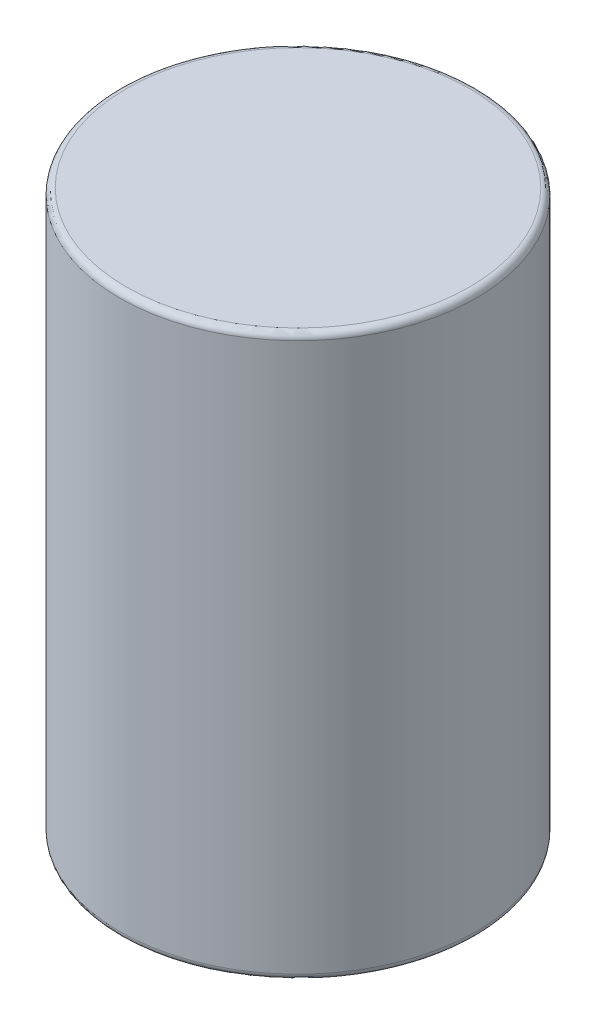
from build123d import *

# Parameters (mm, degrees)
SKETCH1_R           = 8.25
BOSS_EXTRUDE1_DEPTH = 26
FILLET1_R           = 0.3
SKETCH2_R           = 0.375
BOSS_EXTRUDE2_DEPTH = 3


with BuildPart() as part:
    # Sketch1 → Boss-Extrude1 (new body)
    with BuildSketch(Plane(origin=(0, 0, 0), x_dir=(1, 0, 0), z_dir=(0, 1, 0))):
        with Locations(Location((0, 0, 0), (0, 0, 90))):
            Circle(SKETCH1_R)
    extrude(amount=BOSS_EXTRUDE1_DEPTH)

    # Fillet1
    fillet1_edges = [part.edges().sort_by_distance(p)[0] for p in [
        (0, 0, 8.25),
        (0, 26, 8.25),
    ]]
    fillet(fillet1_edges, radius=FILLET1_R)

    # Sketch2 → Boss-Extrude2 (add)
    with BuildSketch(Plane.XZ):
        with Locations(Location((-3.75, 0, 0), (0, 0, 90))):
            Circle(SKETCH2_R)
        with Locations(Location((3.75, 0, 0), (0, 0, 90))):
            Circle(SKETCH2_R)
    extrude(amount=BOSS_EXTRUDE2_DEPTH)


solid = part.part
